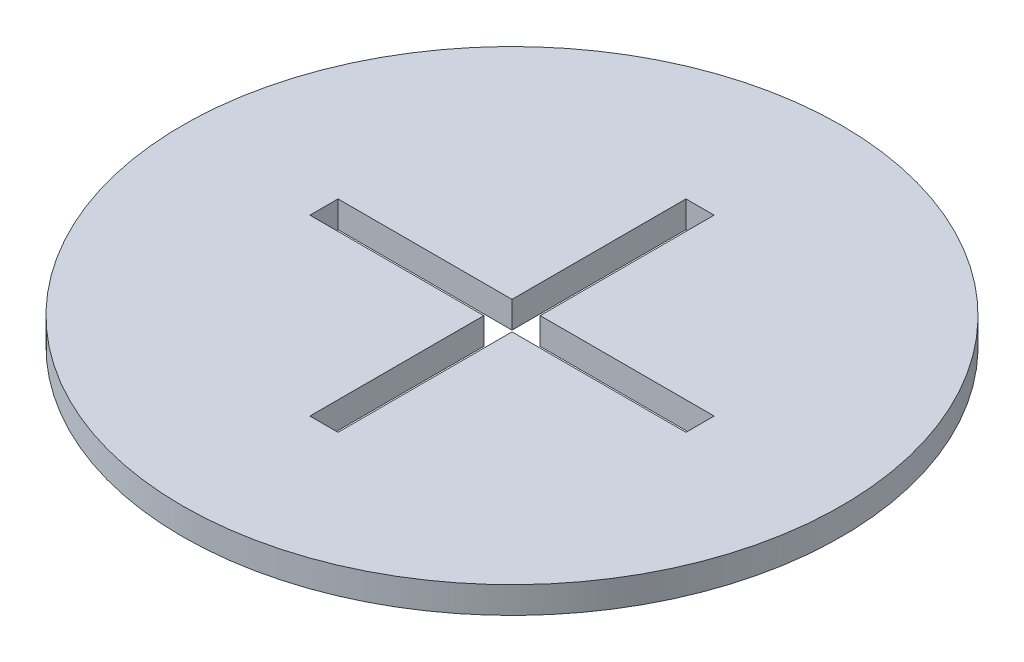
ISO-10303-21;
HEADER;
FILE_DESCRIPTION(('STEP AP214'),'2;1');
FILE_NAME('part.step','',(''),(''),'','','');
FILE_SCHEMA(('AUTOMOTIVE_DESIGN { 1 0 10303 214 1 1 1 1 }'));
ENDSEC;
DATA;
#1=APPLICATION_CONTEXT('core data for automotive mechanical design processes');
#2=APPLICATION_PROTOCOL_DEFINITION('international standard','automotive_design',2000,#1);
#3=PRODUCT_CONTEXT('',#1,'mechanical');
#4=PRODUCT('Part','Part','',(#3));
#5=PRODUCT_RELATED_PRODUCT_CATEGORY('part','',(#4));
#6=PRODUCT_DEFINITION_FORMATION('','',#4);
#7=PRODUCT_DEFINITION_CONTEXT('part definition',#1,'design');
#8=PRODUCT_DEFINITION('design','',#6,#7);
#9=PRODUCT_DEFINITION_SHAPE('','',#8);
#10=(LENGTH_UNIT() NAMED_UNIT(*) SI_UNIT(.MILLI.,.METRE.));
#11=(NAMED_UNIT(*) PLANE_ANGLE_UNIT() SI_UNIT($,.RADIAN.));
#12=(NAMED_UNIT(*) SI_UNIT($,.STERADIAN.) SOLID_ANGLE_UNIT());
#13=UNCERTAINTY_MEASURE_WITH_UNIT(LENGTH_MEASURE(1.E-05),#10,'distance_accuracy_value','');
#14=(GEOMETRIC_REPRESENTATION_CONTEXT(3) GLOBAL_UNCERTAINTY_ASSIGNED_CONTEXT((#13)) GLOBAL_UNIT_ASSIGNED_CONTEXT((#10,
#11,#12)) REPRESENTATION_CONTEXT('',''));
#15=CARTESIAN_POINT('',(0.,0.,0.));
#16=DIRECTION('',(0.,0.,1.));
#17=DIRECTION('',(1.,0.,0.));
#18=AXIS2_PLACEMENT_3D('',#15,#16,#17);
#19=CARTESIAN_POINT('',(222.5,18.,-222.5));
#20=DIRECTION('',(0.,1.,0.));
#21=DIRECTION('',(0.,0.,1.));
#22=AXIS2_PLACEMENT_3D('',#19,#20,#21);
#23=PLANE('',#22);
#24=CARTESIAN_POINT('',(222.5,18.,-222.5));
#25=DIRECTION('',(0.,1.,0.));
#26=DIRECTION('',(0.,0.,1.));
#27=AXIS2_PLACEMENT_3D('',#24,#25,#26);
#28=CIRCLE('',#27,222.5);
#29=CARTESIAN_POINT('',(222.5,18.,0.));
#30=VERTEX_POINT('',#29);
#31=EDGE_CURVE('E11',#30,#30,#28,.T.);
#32=ORIENTED_EDGE('',*,*,#31,.T.);
#33=EDGE_LOOP('',(#32));
#34=FACE_BOUND('',#33,.T.);
#35=DIRECTION('',(0.,0.,1.));
#36=VECTOR('',#35,1.);
#37=CARTESIAN_POINT('',(95.5424814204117,18.,-213.000000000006));
#38=LINE('',#37,#36);
#39=CARTESIAN_POINT('',(95.5424814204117,18.,-231.999999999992));
#40=VERTEX_POINT('',#39);
#41=CARTESIAN_POINT('',(95.5424814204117,18.,-213.000000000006));
#42=VERTEX_POINT('',#41);
#43=EDGE_CURVE('E129',#40,#42,#38,.T.);
#44=ORIENTED_EDGE('',*,*,#43,.F.);
#45=DIRECTION('',(-1.,0.,0.));
#46=VECTOR('',#45,1.);
#47=CARTESIAN_POINT('',(95.5424814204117,18.,-231.999999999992));
#48=LINE('',#47,#46);
#49=CARTESIAN_POINT('',(213.000000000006,18.,-231.999999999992));
#50=VERTEX_POINT('',#49);
#51=EDGE_CURVE('E121',#50,#40,#48,.T.);
#52=ORIENTED_EDGE('',*,*,#51,.F.);
#53=DIRECTION('',(0.,0.,1.));
#54=VECTOR('',#53,1.);
#55=CARTESIAN_POINT('',(213.000000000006,18.,-349.457518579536));
#56=LINE('',#55,#54);
#57=CARTESIAN_POINT('',(213.000000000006,18.,-349.457518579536));
#58=VERTEX_POINT('',#57);
#59=EDGE_CURVE('E161',#58,#50,#56,.T.);
#60=ORIENTED_EDGE('',*,*,#59,.F.);
#61=DIRECTION('',(-1.,0.,0.));
#62=VECTOR('',#61,1.);
#63=CARTESIAN_POINT('',(213.000000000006,18.,-349.457518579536));
#64=LINE('',#63,#62);
#65=CARTESIAN_POINT('',(231.999999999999,18.,-349.457518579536));
#66=VERTEX_POINT('',#65);
#67=EDGE_CURVE('E159',#66,#58,#64,.T.);
#68=ORIENTED_EDGE('',*,*,#67,.F.);
#69=DIRECTION('',(0.,0.,-1.));
#70=VECTOR('',#69,1.);
#71=CARTESIAN_POINT('',(231.999999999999,18.,-349.457518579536));
#72=LINE('',#71,#70);
#73=CARTESIAN_POINT('',(231.999999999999,18.,-231.999999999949));
#74=VERTEX_POINT('',#73);
#75=EDGE_CURVE('E157',#74,#66,#72,.T.);
#76=ORIENTED_EDGE('',*,*,#75,.F.);
#77=DIRECTION('',(-1.,0.,0.));
#78=VECTOR('',#77,1.);
#79=CARTESIAN_POINT('',(349.457518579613,18.,-231.999999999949));
#80=LINE('',#79,#78);
#81=CARTESIAN_POINT('',(349.457518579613,18.,-231.999999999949));
#82=VERTEX_POINT('',#81);
#83=EDGE_CURVE('E155',#82,#74,#80,.T.);
#84=ORIENTED_EDGE('',*,*,#83,.F.);
#85=DIRECTION('',(0.,0.,-1.));
#86=VECTOR('',#85,1.);
#87=CARTESIAN_POINT('',(349.457518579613,18.,-231.999999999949));
#88=LINE('',#87,#86);
#89=CARTESIAN_POINT('',(349.457518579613,18.,-213.000000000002));
#90=VERTEX_POINT('',#89);
#91=EDGE_CURVE('E153',#90,#82,#88,.T.);
#92=ORIENTED_EDGE('',*,*,#91,.F.);
#93=DIRECTION('',(1.,0.,0.));
#94=VECTOR('',#93,1.);
#95=CARTESIAN_POINT('',(349.457518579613,18.,-213.000000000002));
#96=LINE('',#95,#94);
#97=CARTESIAN_POINT('',(231.999999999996,18.,-213.000000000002));
#98=VERTEX_POINT('',#97);
#99=EDGE_CURVE('E151',#98,#90,#96,.T.);
#100=ORIENTED_EDGE('',*,*,#99,.F.);
#101=DIRECTION('',(0.,0.,-1.));
#102=VECTOR('',#101,1.);
#103=CARTESIAN_POINT('',(231.999999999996,18.,-95.5424814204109));
#104=LINE('',#103,#102);
#105=CARTESIAN_POINT('',(231.999999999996,18.,-95.5424814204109));
#106=VERTEX_POINT('',#105);
#107=EDGE_CURVE('E149',#106,#98,#104,.T.);
#108=ORIENTED_EDGE('',*,*,#107,.F.);
#109=DIRECTION('',(1.,0.,0.));
#110=VECTOR('',#109,1.);
#111=CARTESIAN_POINT('',(231.999999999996,18.,-95.5424814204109));
#112=LINE('',#111,#110);
#113=CARTESIAN_POINT('',(213.000000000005,18.,-95.5424814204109));
#114=VERTEX_POINT('',#113);
#115=EDGE_CURVE('E147',#114,#106,#112,.T.);
#116=ORIENTED_EDGE('',*,*,#115,.F.);
#117=DIRECTION('',(0.,0.,1.));
#118=VECTOR('',#117,1.);
#119=CARTESIAN_POINT('',(213.000000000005,18.,-95.5424814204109));
#120=LINE('',#119,#118);
#121=CARTESIAN_POINT('',(213.000000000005,18.,-213.000000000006));
#122=VERTEX_POINT('',#121);
#123=EDGE_CURVE('E143',#122,#114,#120,.T.);
#124=ORIENTED_EDGE('',*,*,#123,.F.);
#125=DIRECTION('',(1.,0.,0.));
#126=VECTOR('',#125,1.);
#127=CARTESIAN_POINT('',(95.5424814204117,18.,-213.000000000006));
#128=LINE('',#127,#126);
#129=EDGE_CURVE('E141',#42,#122,#128,.T.);
#130=ORIENTED_EDGE('',*,*,#129,.F.);
#131=EDGE_LOOP('',(#44,#52,#60,#68,#76,#84,#92,#100,#108,#116,#124,#130));
#132=FACE_BOUND('',#131,.T.);
#133=ADVANCED_FACE('F32',(#34,#132),#23,.T.);
#134=CARTESIAN_POINT('',(222.5,0.,-222.5));
#135=DIRECTION('',(0.,1.,0.));
#136=DIRECTION('',(0.,0.,1.));
#137=AXIS2_PLACEMENT_3D('',#134,#135,#136);
#138=PLANE('',#137);
#139=CARTESIAN_POINT('',(222.5,0.,-222.5));
#140=DIRECTION('',(0.,1.,0.));
#141=DIRECTION('',(0.,0.,1.));
#142=AXIS2_PLACEMENT_3D('',#139,#140,#141);
#143=CIRCLE('',#142,222.5);
#144=CARTESIAN_POINT('',(222.5,0.,0.));
#145=VERTEX_POINT('',#144);
#146=EDGE_CURVE('E36',#145,#145,#143,.T.);
#147=ORIENTED_EDGE('',*,*,#146,.F.);
#148=EDGE_LOOP('',(#147));
#149=FACE_BOUND('',#148,.T.);
#150=DIRECTION('',(-1.,0.,0.));
#151=VECTOR('',#150,1.);
#152=CARTESIAN_POINT('',(95.5424814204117,0.,-231.999999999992));
#153=LINE('',#152,#151);
#154=CARTESIAN_POINT('',(213.000000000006,0.,-231.999999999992));
#155=VERTEX_POINT('',#154);
#156=CARTESIAN_POINT('',(95.5424814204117,0.,-231.999999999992));
#157=VERTEX_POINT('',#156);
#158=EDGE_CURVE('E55',#155,#157,#153,.T.);
#159=ORIENTED_EDGE('',*,*,#158,.T.);
#160=DIRECTION('',(0.,0.,1.));
#161=VECTOR('',#160,1.);
#162=CARTESIAN_POINT('',(95.5424814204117,0.,-213.000000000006));
#163=LINE('',#162,#161);
#164=CARTESIAN_POINT('',(95.5424814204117,0.,-213.000000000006));
#165=VERTEX_POINT('',#164);
#166=EDGE_CURVE('E136',#157,#165,#163,.T.);
#167=ORIENTED_EDGE('',*,*,#166,.T.);
#168=DIRECTION('',(1.,0.,0.));
#169=VECTOR('',#168,1.);
#170=CARTESIAN_POINT('',(95.5424814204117,0.,-213.000000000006));
#171=LINE('',#170,#169);
#172=CARTESIAN_POINT('',(213.000000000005,0.,-213.000000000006));
#173=VERTEX_POINT('',#172);
#174=EDGE_CURVE('E165',#165,#173,#171,.T.);
#175=ORIENTED_EDGE('',*,*,#174,.T.);
#176=DIRECTION('',(0.,0.,1.));
#177=VECTOR('',#176,1.);
#178=CARTESIAN_POINT('',(213.000000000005,0.,-95.5424814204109));
#179=LINE('',#178,#177);
#180=CARTESIAN_POINT('',(213.000000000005,0.,-95.5424814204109));
#181=VERTEX_POINT('',#180);
#182=EDGE_CURVE('E168',#173,#181,#179,.T.);
#183=ORIENTED_EDGE('',*,*,#182,.T.);
#184=DIRECTION('',(1.,0.,0.));
#185=VECTOR('',#184,1.);
#186=CARTESIAN_POINT('',(231.999999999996,0.,-95.5424814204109));
#187=LINE('',#186,#185);
#188=CARTESIAN_POINT('',(231.999999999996,0.,-95.5424814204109));
#189=VERTEX_POINT('',#188);
#190=EDGE_CURVE('E171',#181,#189,#187,.T.);
#191=ORIENTED_EDGE('',*,*,#190,.T.);
#192=DIRECTION('',(0.,0.,-1.));
#193=VECTOR('',#192,1.);
#194=CARTESIAN_POINT('',(231.999999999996,0.,-95.5424814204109));
#195=LINE('',#194,#193);
#196=CARTESIAN_POINT('',(231.999999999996,0.,-213.000000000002));
#197=VERTEX_POINT('',#196);
#198=EDGE_CURVE('E174',#189,#197,#195,.T.);
#199=ORIENTED_EDGE('',*,*,#198,.T.);
#200=DIRECTION('',(1.,0.,0.));
#201=VECTOR('',#200,1.);
#202=CARTESIAN_POINT('',(349.457518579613,0.,-213.000000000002));
#203=LINE('',#202,#201);
#204=CARTESIAN_POINT('',(349.457518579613,0.,-213.000000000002));
#205=VERTEX_POINT('',#204);
#206=EDGE_CURVE('E177',#197,#205,#203,.T.);
#207=ORIENTED_EDGE('',*,*,#206,.T.);
#208=DIRECTION('',(0.,0.,-1.));
#209=VECTOR('',#208,1.);
#210=CARTESIAN_POINT('',(349.457518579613,0.,-231.999999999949));
#211=LINE('',#210,#209);
#212=CARTESIAN_POINT('',(349.457518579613,0.,-231.999999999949));
#213=VERTEX_POINT('',#212);
#214=EDGE_CURVE('E180',#205,#213,#211,.T.);
#215=ORIENTED_EDGE('',*,*,#214,.T.);
#216=DIRECTION('',(-1.,0.,0.));
#217=VECTOR('',#216,1.);
#218=CARTESIAN_POINT('',(349.457518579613,0.,-231.999999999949));
#219=LINE('',#218,#217);
#220=CARTESIAN_POINT('',(231.999999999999,0.,-231.999999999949));
#221=VERTEX_POINT('',#220);
#222=EDGE_CURVE('E183',#213,#221,#219,.T.);
#223=ORIENTED_EDGE('',*,*,#222,.T.);
#224=DIRECTION('',(0.,0.,-1.));
#225=VECTOR('',#224,1.);
#226=CARTESIAN_POINT('',(231.999999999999,0.,-349.457518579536));
#227=LINE('',#226,#225);
#228=CARTESIAN_POINT('',(231.999999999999,0.,-349.457518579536));
#229=VERTEX_POINT('',#228);
#230=EDGE_CURVE('E186',#221,#229,#227,.T.);
#231=ORIENTED_EDGE('',*,*,#230,.T.);
#232=DIRECTION('',(-1.,0.,0.));
#233=VECTOR('',#232,1.);
#234=CARTESIAN_POINT('',(213.000000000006,0.,-349.457518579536));
#235=LINE('',#234,#233);
#236=CARTESIAN_POINT('',(213.000000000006,0.,-349.457518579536));
#237=VERTEX_POINT('',#236);
#238=EDGE_CURVE('E189',#229,#237,#235,.T.);
#239=ORIENTED_EDGE('',*,*,#238,.T.);
#240=DIRECTION('',(0.,0.,1.));
#241=VECTOR('',#240,1.);
#242=CARTESIAN_POINT('',(213.000000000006,0.,-349.457518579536));
#243=LINE('',#242,#241);
#244=EDGE_CURVE('E130',#237,#155,#243,.T.);
#245=ORIENTED_EDGE('',*,*,#244,.T.);
#246=EDGE_LOOP('',(#159,#167,#175,#183,#191,#199,#207,#215,#223,#231,#239,#245));
#247=FACE_BOUND('',#246,.T.);
#248=ADVANCED_FACE('F218',(#149,#247),#138,.F.);
#249=CARTESIAN_POINT('',(222.5,18.,-222.5));
#250=DIRECTION('',(0.,-1.,0.));
#251=DIRECTION('',(0.,0.,-1.));
#252=AXIS2_PLACEMENT_3D('',#249,#250,#251);
#253=CYLINDRICAL_SURFACE('',#252,222.5);
#254=ORIENTED_EDGE('',*,*,#31,.F.);
#255=EDGE_LOOP('',(#254));
#256=FACE_BOUND('',#255,.T.);
#257=ORIENTED_EDGE('',*,*,#146,.T.);
#258=EDGE_LOOP('',(#257));
#259=FACE_BOUND('',#258,.T.);
#260=ADVANCED_FACE('F34',(#256,#259),#253,.T.);
#261=CARTESIAN_POINT('',(95.5424814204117,18.,-231.999999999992));
#262=DIRECTION('',(0.,0.,1.));
#263=DIRECTION('',(1.,0.,0.));
#264=AXIS2_PLACEMENT_3D('',#261,#262,#263);
#265=PLANE('',#264);
#266=ORIENTED_EDGE('',*,*,#158,.F.);
#267=DIRECTION('',(0.,-1.,0.));
#268=VECTOR('',#267,1.);
#269=CARTESIAN_POINT('',(213.000000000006,18.,-231.999999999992));
#270=LINE('',#269,#268);
#271=EDGE_CURVE('E125',#50,#155,#270,.T.);
#272=ORIENTED_EDGE('',*,*,#271,.F.);
#273=ORIENTED_EDGE('',*,*,#51,.T.);
#274=DIRECTION('',(0.,-1.,0.));
#275=VECTOR('',#274,1.);
#276=CARTESIAN_POINT('',(95.5424814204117,18.,-231.999999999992));
#277=LINE('',#276,#275);
#278=EDGE_CURVE('E124',#40,#157,#277,.T.);
#279=ORIENTED_EDGE('',*,*,#278,.T.);
#280=EDGE_LOOP('',(#266,#272,#273,#279));
#281=FACE_BOUND('',#280,.T.);
#282=ADVANCED_FACE('F123',(#281),#265,.T.);
#283=CARTESIAN_POINT('',(95.5424814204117,18.,-213.000000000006));
#284=DIRECTION('',(1.,0.,0.));
#285=DIRECTION('',(0.,0.,-1.));
#286=AXIS2_PLACEMENT_3D('',#283,#284,#285);
#287=PLANE('',#286);
#288=ORIENTED_EDGE('',*,*,#166,.F.);
#289=ORIENTED_EDGE('',*,*,#278,.F.);
#290=ORIENTED_EDGE('',*,*,#43,.T.);
#291=DIRECTION('',(0.,-1.,0.));
#292=VECTOR('',#291,1.);
#293=CARTESIAN_POINT('',(95.5424814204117,18.,-213.000000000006));
#294=LINE('',#293,#292);
#295=EDGE_CURVE('E137',#42,#165,#294,.T.);
#296=ORIENTED_EDGE('',*,*,#295,.T.);
#297=EDGE_LOOP('',(#288,#289,#290,#296));
#298=FACE_BOUND('',#297,.T.);
#299=ADVANCED_FACE('F133',(#298),#287,.T.);
#300=CARTESIAN_POINT('',(95.5424814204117,18.,-213.000000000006));
#301=DIRECTION('',(0.,0.,-1.));
#302=DIRECTION('',(-1.,0.,0.));
#303=AXIS2_PLACEMENT_3D('',#300,#301,#302);
#304=PLANE('',#303);
#305=ORIENTED_EDGE('',*,*,#174,.F.);
#306=ORIENTED_EDGE('',*,*,#295,.F.);
#307=ORIENTED_EDGE('',*,*,#129,.T.);
#308=DIRECTION('',(0.,-1.,0.));
#309=VECTOR('',#308,1.);
#310=CARTESIAN_POINT('',(213.000000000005,18.,-213.000000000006));
#311=LINE('',#310,#309);
#312=EDGE_CURVE('E210',#122,#173,#311,.T.);
#313=ORIENTED_EDGE('',*,*,#312,.T.);
#314=EDGE_LOOP('',(#305,#306,#307,#313));
#315=FACE_BOUND('',#314,.T.);
#316=ADVANCED_FACE('F214',(#315),#304,.T.);
#317=CARTESIAN_POINT('',(213.000000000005,18.,-95.5424814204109));
#318=DIRECTION('',(1.,0.,0.));
#319=DIRECTION('',(0.,0.,-1.));
#320=AXIS2_PLACEMENT_3D('',#317,#318,#319);
#321=PLANE('',#320);
#322=ORIENTED_EDGE('',*,*,#182,.F.);
#323=ORIENTED_EDGE('',*,*,#312,.F.);
#324=ORIENTED_EDGE('',*,*,#123,.T.);
#325=DIRECTION('',(0.,-1.,0.));
#326=VECTOR('',#325,1.);
#327=CARTESIAN_POINT('',(213.000000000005,18.,-95.5424814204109));
#328=LINE('',#327,#326);
#329=EDGE_CURVE('E208',#114,#181,#328,.T.);
#330=ORIENTED_EDGE('',*,*,#329,.T.);
#331=EDGE_LOOP('',(#322,#323,#324,#330));
#332=FACE_BOUND('',#331,.T.);
#333=ADVANCED_FACE('F256',(#332),#321,.T.);
#334=CARTESIAN_POINT('',(231.999999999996,18.,-95.5424814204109));
#335=DIRECTION('',(0.,0.,-1.));
#336=DIRECTION('',(-1.,0.,0.));
#337=AXIS2_PLACEMENT_3D('',#334,#335,#336);
#338=PLANE('',#337);
#339=ORIENTED_EDGE('',*,*,#190,.F.);
#340=ORIENTED_EDGE('',*,*,#329,.F.);
#341=ORIENTED_EDGE('',*,*,#115,.T.);
#342=DIRECTION('',(0.,-1.,0.));
#343=VECTOR('',#342,1.);
#344=CARTESIAN_POINT('',(231.999999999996,18.,-95.5424814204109));
#345=LINE('',#344,#343);
#346=EDGE_CURVE('E206',#106,#189,#345,.T.);
#347=ORIENTED_EDGE('',*,*,#346,.T.);
#348=EDGE_LOOP('',(#339,#340,#341,#347));
#349=FACE_BOUND('',#348,.T.);
#350=ADVANCED_FACE('F254',(#349),#338,.T.);
#351=CARTESIAN_POINT('',(231.999999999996,18.,-95.5424814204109));
#352=DIRECTION('',(-1.,0.,0.));
#353=DIRECTION('',(0.,0.,1.));
#354=AXIS2_PLACEMENT_3D('',#351,#352,#353);
#355=PLANE('',#354);
#356=ORIENTED_EDGE('',*,*,#198,.F.);
#357=ORIENTED_EDGE('',*,*,#346,.F.);
#358=ORIENTED_EDGE('',*,*,#107,.T.);
#359=DIRECTION('',(0.,-1.,0.));
#360=VECTOR('',#359,1.);
#361=CARTESIAN_POINT('',(231.999999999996,18.,-213.000000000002));
#362=LINE('',#361,#360);
#363=EDGE_CURVE('E204',#98,#197,#362,.T.);
#364=ORIENTED_EDGE('',*,*,#363,.T.);
#365=EDGE_LOOP('',(#356,#357,#358,#364));
#366=FACE_BOUND('',#365,.T.);
#367=ADVANCED_FACE('F248',(#366),#355,.T.);
#368=CARTESIAN_POINT('',(349.457518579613,18.,-213.000000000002));
#369=DIRECTION('',(0.,0.,-1.));
#370=DIRECTION('',(-1.,0.,0.));
#371=AXIS2_PLACEMENT_3D('',#368,#369,#370);
#372=PLANE('',#371);
#373=ORIENTED_EDGE('',*,*,#206,.F.);
#374=ORIENTED_EDGE('',*,*,#363,.F.);
#375=ORIENTED_EDGE('',*,*,#99,.T.);
#376=DIRECTION('',(0.,-1.,0.));
#377=VECTOR('',#376,1.);
#378=CARTESIAN_POINT('',(349.457518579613,18.,-213.000000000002));
#379=LINE('',#378,#377);
#380=EDGE_CURVE('E202',#90,#205,#379,.T.);
#381=ORIENTED_EDGE('',*,*,#380,.T.);
#382=EDGE_LOOP('',(#373,#374,#375,#381));
#383=FACE_BOUND('',#382,.T.);
#384=ADVANCED_FACE('F244',(#383),#372,.T.);
#385=CARTESIAN_POINT('',(349.457518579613,18.,-231.999999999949));
#386=DIRECTION('',(-1.,0.,0.));
#387=DIRECTION('',(0.,0.,1.));
#388=AXIS2_PLACEMENT_3D('',#385,#386,#387);
#389=PLANE('',#388);
#390=ORIENTED_EDGE('',*,*,#214,.F.);
#391=ORIENTED_EDGE('',*,*,#380,.F.);
#392=ORIENTED_EDGE('',*,*,#91,.T.);
#393=DIRECTION('',(0.,-1.,0.));
#394=VECTOR('',#393,1.);
#395=CARTESIAN_POINT('',(349.457518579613,18.,-231.999999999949));
#396=LINE('',#395,#394);
#397=EDGE_CURVE('E200',#82,#213,#396,.T.);
#398=ORIENTED_EDGE('',*,*,#397,.T.);
#399=EDGE_LOOP('',(#390,#391,#392,#398));
#400=FACE_BOUND('',#399,.T.);
#401=ADVANCED_FACE('F241',(#400),#389,.T.);
#402=CARTESIAN_POINT('',(349.457518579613,18.,-231.999999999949));
#403=DIRECTION('',(0.,0.,1.));
#404=DIRECTION('',(1.,0.,0.));
#405=AXIS2_PLACEMENT_3D('',#402,#403,#404);
#406=PLANE('',#405);
#407=ORIENTED_EDGE('',*,*,#222,.F.);
#408=ORIENTED_EDGE('',*,*,#397,.F.);
#409=ORIENTED_EDGE('',*,*,#83,.T.);
#410=DIRECTION('',(0.,-1.,0.));
#411=VECTOR('',#410,1.);
#412=CARTESIAN_POINT('',(231.999999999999,18.,-231.999999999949));
#413=LINE('',#412,#411);
#414=EDGE_CURVE('E198',#74,#221,#413,.T.);
#415=ORIENTED_EDGE('',*,*,#414,.T.);
#416=EDGE_LOOP('',(#407,#408,#409,#415));
#417=FACE_BOUND('',#416,.T.);
#418=ADVANCED_FACE('F233',(#417),#406,.T.);
#419=CARTESIAN_POINT('',(231.999999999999,18.,-349.457518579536));
#420=DIRECTION('',(-1.,0.,0.));
#421=DIRECTION('',(0.,0.,1.));
#422=AXIS2_PLACEMENT_3D('',#419,#420,#421);
#423=PLANE('',#422);
#424=ORIENTED_EDGE('',*,*,#230,.F.);
#425=ORIENTED_EDGE('',*,*,#414,.F.);
#426=ORIENTED_EDGE('',*,*,#75,.T.);
#427=DIRECTION('',(0.,-1.,0.));
#428=VECTOR('',#427,1.);
#429=CARTESIAN_POINT('',(231.999999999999,18.,-349.457518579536));
#430=LINE('',#429,#428);
#431=EDGE_CURVE('E196',#66,#229,#430,.T.);
#432=ORIENTED_EDGE('',*,*,#431,.T.);
#433=EDGE_LOOP('',(#424,#425,#426,#432));
#434=FACE_BOUND('',#433,.T.);
#435=ADVANCED_FACE('F229',(#434),#423,.T.);
#436=CARTESIAN_POINT('',(213.000000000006,18.,-349.457518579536));
#437=DIRECTION('',(0.,0.,1.));
#438=DIRECTION('',(1.,0.,0.));
#439=AXIS2_PLACEMENT_3D('',#436,#437,#438);
#440=PLANE('',#439);
#441=ORIENTED_EDGE('',*,*,#238,.F.);
#442=ORIENTED_EDGE('',*,*,#431,.F.);
#443=ORIENTED_EDGE('',*,*,#67,.T.);
#444=DIRECTION('',(0.,-1.,0.));
#445=VECTOR('',#444,1.);
#446=CARTESIAN_POINT('',(213.000000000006,18.,-349.457518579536));
#447=LINE('',#446,#445);
#448=EDGE_CURVE('E47',#58,#237,#447,.T.);
#449=ORIENTED_EDGE('',*,*,#448,.T.);
#450=EDGE_LOOP('',(#441,#442,#443,#449));
#451=FACE_BOUND('',#450,.T.);
#452=ADVANCED_FACE('F226',(#451),#440,.T.);
#453=CARTESIAN_POINT('',(213.000000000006,18.,-349.457518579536));
#454=DIRECTION('',(1.,0.,0.));
#455=DIRECTION('',(0.,0.,-1.));
#456=AXIS2_PLACEMENT_3D('',#453,#454,#455);
#457=PLANE('',#456);
#458=ORIENTED_EDGE('',*,*,#244,.F.);
#459=ORIENTED_EDGE('',*,*,#448,.F.);
#460=ORIENTED_EDGE('',*,*,#59,.T.);
#461=ORIENTED_EDGE('',*,*,#271,.T.);
#462=EDGE_LOOP('',(#458,#459,#460,#461));
#463=FACE_BOUND('',#462,.T.);
#464=ADVANCED_FACE('F220',(#463),#457,.T.);
#465=CLOSED_SHELL('',(#133,#248,#260,#282,#299,#316,#333,#350,#367,#384,#401,#418,#435,#452,#464));
#466=MANIFOLD_SOLID_BREP('B2',#465);
#467=ADVANCED_BREP_SHAPE_REPRESENTATION('',(#18,#466),#14);
#468=SHAPE_DEFINITION_REPRESENTATION(#9,#467);
ENDSEC;
END-ISO-10303-21;
